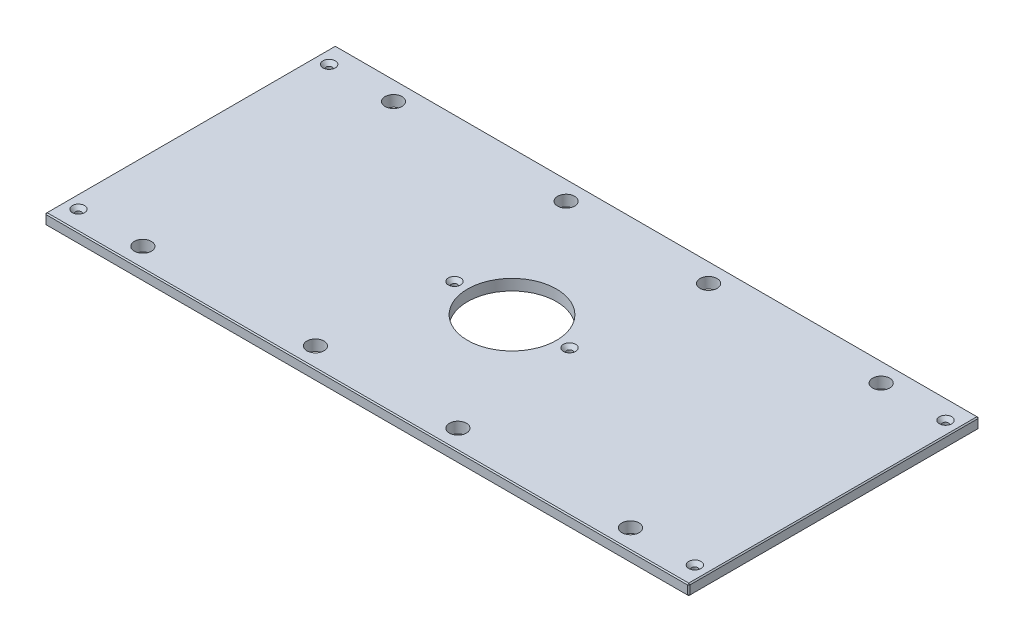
from build123d import *

# Parameters (mm, degrees)
SKETCH1_W                                        = 746.125
SKETCH1_H                                        = 336.55
BOSS_EXTRUDE1_DEPTH                              = 12.7
SKETCH13_R                                       = 51.562
CUT_EXTRUDE6_DEPTH                               = 410.454996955
F_25_32_0_78125_DIAMETER_HOLE1_D                 = 19.84375
CHAMFER2_SIZE                                    = 1.27
CSK_FOR_1_4_FLAT_HEAD_MACHINE_SCREW1_D           = 6.7564
CSK_FOR_1_4_FLAT_HEAD_MACHINE_SCREW1_CSINK_D     = 14.2748
CSK_FOR_1_4_FLAT_HEAD_MACHINE_SCREW1_CSINK_ANGLE = 82


with BuildPart() as part:
    # Sketch1 → Boss-Extrude1 (new body)
    with BuildSketch(Plane(origin=(0, 0, 0), x_dir=(1, 0, 0), z_dir=(0, 1, 0))):
        Rectangle(SKETCH1_W, SKETCH1_H)
    extrude(amount=BOSS_EXTRUDE1_DEPTH)

    # Sketch13 → Cut-Extrude6 (cut, through all)
    with BuildSketch(Plane(origin=(0, 12.7, 0), x_dir=(1, 0, 0), z_dir=(0, 1, 0))):
        with Locations(Location((0, 0, 0), (0, 0, 270))):
            Circle(SKETCH13_R)
    extrude(amount=-CUT_EXTRUDE6_DEPTH, mode=Mode.SUBTRACT)

    # 25_32 _0.78125_ Diameter Hole1 (through all)
    with Locations(Plane(origin=(0, 12.7, 0), x_dir=(1, 0, 0), z_dir=(0, 1, 0))):
        with Locations((282.575, 145.25498), (-282.575, 145.25498), (282.575, -145.25498), (-282.575, -145.25498), (-82.55, 145.25498), (82.55, 145.25498), (82.55, -145.25498), (-82.55, -145.25498)):
            Hole(F_25_32_0_78125_DIAMETER_HOLE1_D / 2)

    # Chamfer2
    chamfer2_edges = [part.edges().sort_by_distance(p)[0] for p in [
        (373.0625, 12.7, 0),
        (0, 12.7, -168.275),
        (-373.0625, 12.7, 0),
        (0, 0, -168.275),
        (373.0625, 0, 0),
        (0, 0, 168.275),
        (-373.0625, 0, 0),
        (0, 12.7, 168.275),
        (-373.0625, 6.35, -168.275),
        (373.0625, 6.35, -168.275),
        (373.0625, 6.35, 168.275),
        (-373.0625, 6.35, 168.275),
    ]]
    chamfer(chamfer2_edges, length=CHAMFER2_SIZE)

    # CSK for 1_4 Flat Head Machine Screw1 (through all)
    with Locations(Plane(origin=(0, 12.7, 0), x_dir=(1, 0, 0), z_dir=(0, 1, 0))):
        with Locations((357.1875, 145.25498), (357.1875, -145.25498), (-357.1875, -145.25498), (-66.675, 0), (66.675, 0), (-357.1875, 145.25498), (-282.575, 145.25498), (-282.575, -145.25498)):
            CounterSinkHole(CSK_FOR_1_4_FLAT_HEAD_MACHINE_SCREW1_D / 2, CSK_FOR_1_4_FLAT_HEAD_MACHINE_SCREW1_CSINK_D / 2, counter_sink_angle=CSK_FOR_1_4_FLAT_HEAD_MACHINE_SCREW1_CSINK_ANGLE)


solid = part.part
